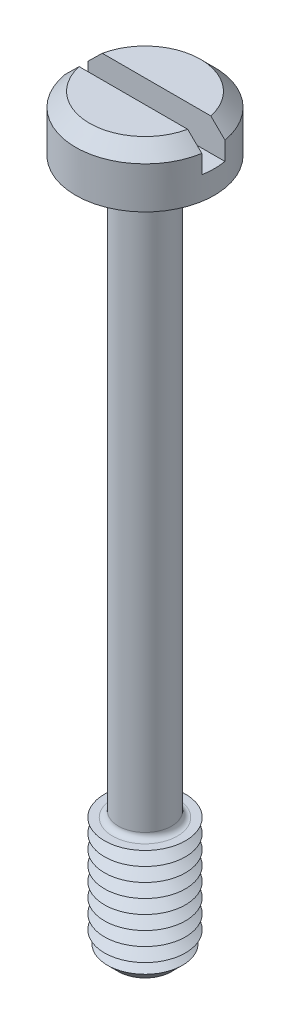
from build123d import *

# Parameters (mm, degrees)
SKETCH1_R           = 3
BOSS_EXTRUDE1_DEPTH = 2.4
SKETCH2_R           = 1.15
BOSS_EXTRUDE2_DEPTH = 30
SKETCH3_R           = 1.75
BOSS_EXTRUDE3_DEPTH = 5.2
CHAMFER1_SIZE       = 0.6
LPATTERN1_COUNT     = 8
LPATTERN1_PITCH     = 0.6
FILLET1_R           = 0.25
CHAMFER2_SIZE       = 0.6
SKETCH6_W           = 6
SKETCH6_H           = 1
CUT_EXTRUDE1_DEPTH  = 1.4


with BuildPart() as part:
    # Sketch1 → Boss-Extrude1 (new body)
    with BuildSketch(Plane(origin=(0, 0, 0), x_dir=(1, 0, 0), z_dir=(0, 1, 0))):
        with Locations(Location((0, 0, 0), (0, 0, 270))):
            Circle(SKETCH1_R)
    extrude(amount=BOSS_EXTRUDE1_DEPTH)

    # Sketch2 → Boss-Extrude2 (add)
    with BuildSketch(Plane.XZ):
        with Locations(Location((0, 0, 0), (0, 0, 270))):
            Circle(SKETCH2_R)
    extrude(amount=BOSS_EXTRUDE2_DEPTH)

    # Sketch3 → Boss-Extrude3 (add)
    with BuildSketch(Plane.XZ.offset(30)):
        with Locations(Location((0, 0, 0), (0, 0, 270))):
            Circle(SKETCH3_R)
    extrude(amount=-BOSS_EXTRUDE3_DEPTH)

    # Chamfer1
    chamfer1_edges = [part.edges().sort_by_distance(p)[0] for p in [
        (0, -30, 1.75),
    ]]
    chamfer(chamfer1_edges, length=CHAMFER1_SIZE)

    # Sketch5 → Cut-Revolve1 (revolve, cut)
    with BuildSketch(Plane(origin=(0, 0, 0), x_dir=(0, 0, -1), z_dir=(1, 0, 0))):
        Polygon((-1.75, -24.8), (-1.230384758, -25.1), (-1.75, -25.4), align=None)
    cut_revolve1 = revolve(axis=Axis((0, -6.58711856, 0), (0, -1, 0)), mode=Mode.SUBTRACT)

    # LPattern1: Cut-Revolve1 ×8
    with Locations(*[(0, -i * LPATTERN1_PITCH, 0) for i in range(1, LPATTERN1_COUNT)]):
        add(cut_revolve1, mode=Mode.SUBTRACT)

    # Fillet1
    fillet1_edges = [part.edges().sort_by_distance(p)[0] for p in [
        (0, 0, 1.15),
        (0, -24.8, 1.15),
    ]]
    fillet(fillet1_edges, radius=FILLET1_R)

    # Chamfer2
    chamfer2_edges = [part.edges().sort_by_distance(p)[0] for p in [
        (0, 2.4, -3),
    ]]
    chamfer(chamfer2_edges, length=CHAMFER2_SIZE)

    # Sketch6 → Cut-Extrude1 (cut)
    with BuildSketch(Plane(origin=(0, 2.4, 0), x_dir=(1, 0, 0), z_dir=(0, 1, 0))):
        Rectangle(SKETCH6_W, SKETCH6_H)
    extrude(amount=-CUT_EXTRUDE1_DEPTH, mode=Mode.SUBTRACT)


solid = part.part
